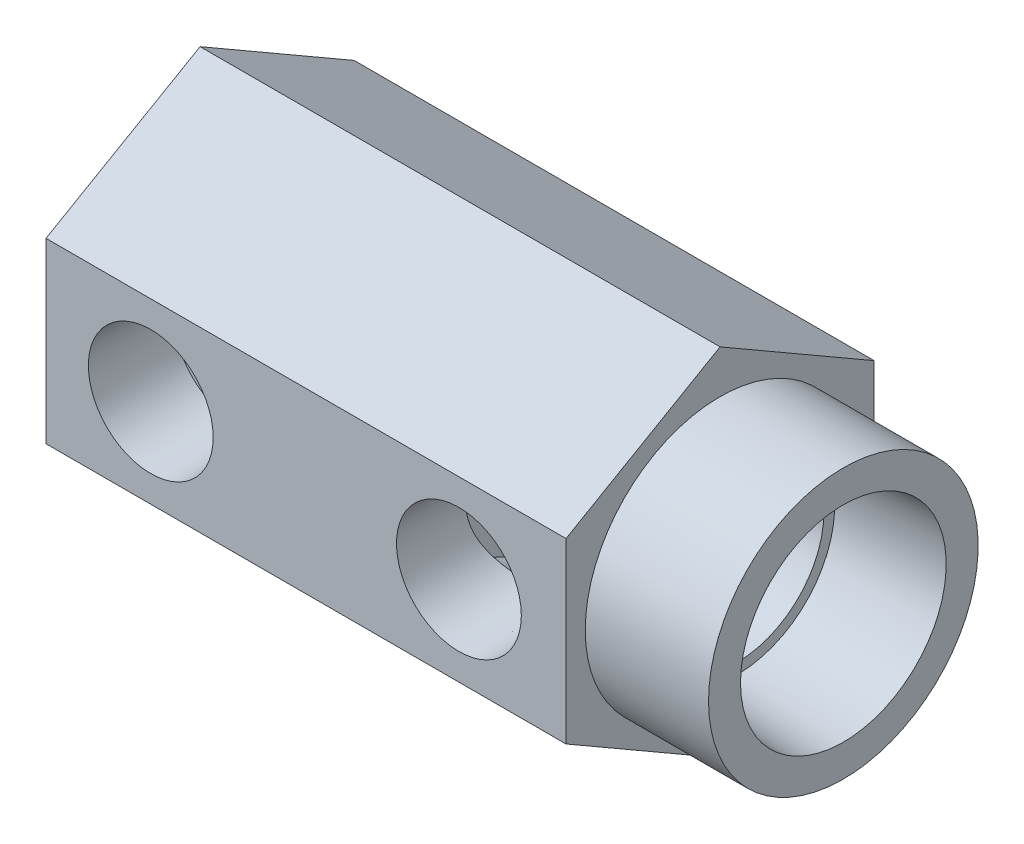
ISO-10303-21;
HEADER;
FILE_DESCRIPTION(('STEP AP214'),'2;1');
FILE_NAME('part.step','',(''),(''),'','','');
FILE_SCHEMA(('AUTOMOTIVE_DESIGN { 1 0 10303 214 1 1 1 1 }'));
ENDSEC;
DATA;
#1=APPLICATION_CONTEXT('core data for automotive mechanical design processes');
#2=APPLICATION_PROTOCOL_DEFINITION('international standard','automotive_design',2000,#1);
#3=PRODUCT_CONTEXT('',#1,'mechanical');
#4=PRODUCT('Part','Part','',(#3));
#5=PRODUCT_RELATED_PRODUCT_CATEGORY('part','',(#4));
#6=PRODUCT_DEFINITION_FORMATION('','',#4);
#7=PRODUCT_DEFINITION_CONTEXT('part definition',#1,'design');
#8=PRODUCT_DEFINITION('design','',#6,#7);
#9=PRODUCT_DEFINITION_SHAPE('','',#8);
#10=(LENGTH_UNIT() NAMED_UNIT(*) SI_UNIT(.MILLI.,.METRE.));
#11=(NAMED_UNIT(*) PLANE_ANGLE_UNIT() SI_UNIT($,.RADIAN.));
#12=(NAMED_UNIT(*) SI_UNIT($,.STERADIAN.) SOLID_ANGLE_UNIT());
#13=UNCERTAINTY_MEASURE_WITH_UNIT(LENGTH_MEASURE(1.E-05),#10,'distance_accuracy_value','');
#14=(GEOMETRIC_REPRESENTATION_CONTEXT(3) GLOBAL_UNCERTAINTY_ASSIGNED_CONTEXT((#13)) GLOBAL_UNIT_ASSIGNED_CONTEXT((#10,
#11,#12)) REPRESENTATION_CONTEXT('',''));
#15=CARTESIAN_POINT('',(0.,0.,0.));
#16=DIRECTION('',(0.,0.,1.));
#17=DIRECTION('',(1.,0.,0.));
#18=AXIS2_PLACEMENT_3D('',#15,#16,#17);
#19=CARTESIAN_POINT('',(42.8625,-7.33234841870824,-12.7));
#20=DIRECTION('',(0.,0.,1.));
#21=DIRECTION('',(1.,0.,0.));
#22=AXIS2_PLACEMENT_3D('',#19,#20,#21);
#23=PLANE('',#22);
#24=DIRECTION('',(0.,1.,0.));
#25=VECTOR('',#24,1.);
#26=CARTESIAN_POINT('',(0.,-7.33234841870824,-12.7));
#27=LINE('',#26,#25);
#28=CARTESIAN_POINT('',(0.,-7.33234841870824,-12.7));
#29=VERTEX_POINT('',#28);
#30=CARTESIAN_POINT('',(0.,7.33234841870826,-12.7));
#31=VERTEX_POINT('',#30);
#32=EDGE_CURVE('E121',#29,#31,#27,.T.);
#33=ORIENTED_EDGE('',*,*,#32,.T.);
#34=DIRECTION('',(-1.,0.,0.));
#35=VECTOR('',#34,1.);
#36=CARTESIAN_POINT('',(42.8625,7.33234841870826,-12.7));
#37=LINE('',#36,#35);
#38=CARTESIAN_POINT('',(42.8625,7.33234841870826,-12.7));
#39=VERTEX_POINT('',#38);
#40=EDGE_CURVE('E118',#39,#31,#37,.T.);
#41=ORIENTED_EDGE('',*,*,#40,.F.);
#42=DIRECTION('',(0.,1.,0.));
#43=VECTOR('',#42,1.);
#44=CARTESIAN_POINT('',(42.8625,-7.33234841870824,-12.7));
#45=LINE('',#44,#43);
#46=CARTESIAN_POINT('',(42.8625,-7.33234841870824,-12.7));
#47=VERTEX_POINT('',#46);
#48=EDGE_CURVE('E105',#47,#39,#45,.T.);
#49=ORIENTED_EDGE('',*,*,#48,.F.);
#50=DIRECTION('',(-1.,0.,0.));
#51=VECTOR('',#50,1.);
#52=CARTESIAN_POINT('',(42.8625,-7.33234841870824,-12.7));
#53=LINE('',#52,#51);
#54=EDGE_CURVE('E124',#47,#29,#53,.T.);
#55=ORIENTED_EDGE('',*,*,#54,.T.);
#56=EDGE_LOOP('',(#33,#41,#49,#55));
#57=FACE_BOUND('',#56,.T.);
#58=CARTESIAN_POINT('',(8.636,0.,-12.7));
#59=DIRECTION('',(0.,0.,-1.));
#60=DIRECTION('',(-1.,0.,0.));
#61=AXIS2_PLACEMENT_3D('',#58,#59,#60);
#62=CIRCLE('',#61,5.1435);
#63=CARTESIAN_POINT('',(3.4925,0.,-12.7));
#64=VERTEX_POINT('',#63);
#65=EDGE_CURVE('E198',#64,#64,#62,.T.);
#66=ORIENTED_EDGE('',*,*,#65,.F.);
#67=EDGE_LOOP('',(#66));
#68=FACE_BOUND('',#67,.T.);
#69=ADVANCED_FACE('F35',(#57,#68),#23,.F.);
#70=CARTESIAN_POINT('',(53.0225,0.,0.));
#71=DIRECTION('',(-1.,0.,0.));
#72=DIRECTION('',(0.,0.,1.));
#73=AXIS2_PLACEMENT_3D('',#70,#71,#72);
#74=PLANE('',#73);
#75=CARTESIAN_POINT('',(53.0225,0.,0.));
#76=DIRECTION('',(-1.,0.,0.));
#77=DIRECTION('',(0.,0.,1.));
#78=AXIS2_PLACEMENT_3D('',#75,#76,#77);
#79=CIRCLE('',#78,11.1125);
#80=CARTESIAN_POINT('',(53.0225,0.,11.1125));
#81=VERTEX_POINT('',#80);
#82=EDGE_CURVE('E137',#81,#81,#79,.T.);
#83=ORIENTED_EDGE('',*,*,#82,.F.);
#84=EDGE_LOOP('',(#83));
#85=FACE_BOUND('',#84,.T.);
#86=CARTESIAN_POINT('',(53.0225,0.,0.));
#87=DIRECTION('',(-1.,0.,0.));
#88=DIRECTION('',(0.,0.,1.));
#89=AXIS2_PLACEMENT_3D('',#86,#87,#88);
#90=CIRCLE('',#89,8.47725);
#91=CARTESIAN_POINT('',(53.0225,0.,8.47725));
#92=VERTEX_POINT('',#91);
#93=EDGE_CURVE('E272',#92,#92,#90,.T.);
#94=ORIENTED_EDGE('',*,*,#93,.T.);
#95=EDGE_LOOP('',(#94));
#96=FACE_BOUND('',#95,.T.);
#97=ADVANCED_FACE('F229',(#85,#96),#74,.F.);
#98=CARTESIAN_POINT('',(42.8625,7.33234841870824,12.7));
#99=DIRECTION('',(0.,0.,-1.));
#100=DIRECTION('',(0.,1.,0.));
#101=AXIS2_PLACEMENT_3D('',#98,#99,#100);
#102=PLANE('',#101);
#103=CARTESIAN_POINT('',(8.636,0.,12.7));
#104=DIRECTION('',(0.,0.,1.));
#105=DIRECTION('',(1.,0.,0.));
#106=AXIS2_PLACEMENT_3D('',#103,#104,#105);
#107=CIRCLE('',#106,5.1435);
#108=CARTESIAN_POINT('',(13.7795,0.,12.7));
#109=VERTEX_POINT('',#108);
#110=EDGE_CURVE('E291',#109,#109,#107,.T.);
#111=ORIENTED_EDGE('',*,*,#110,.F.);
#112=EDGE_LOOP('',(#111));
#113=FACE_BOUND('',#112,.T.);
#114=CARTESIAN_POINT('',(34.036,0.,12.7));
#115=DIRECTION('',(0.,0.,1.));
#116=DIRECTION('',(1.,0.,0.));
#117=AXIS2_PLACEMENT_3D('',#114,#115,#116);
#118=CIRCLE('',#117,5.1435);
#119=CARTESIAN_POINT('',(39.1795,0.,12.7));
#120=VERTEX_POINT('',#119);
#121=EDGE_CURVE('E282',#120,#120,#118,.T.);
#122=ORIENTED_EDGE('',*,*,#121,.F.);
#123=EDGE_LOOP('',(#122));
#124=FACE_BOUND('',#123,.T.);
#125=DIRECTION('',(0.,-1.,0.));
#126=VECTOR('',#125,1.);
#127=CARTESIAN_POINT('',(0.,7.33234841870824,12.7));
#128=LINE('',#127,#126);
#129=CARTESIAN_POINT('',(0.,7.33234841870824,12.7));
#130=VERTEX_POINT('',#129);
#131=CARTESIAN_POINT('',(0.,-7.33234841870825,12.7));
#132=VERTEX_POINT('',#131);
#133=EDGE_CURVE('E133',#130,#132,#128,.T.);
#134=ORIENTED_EDGE('',*,*,#133,.T.);
#135=DIRECTION('',(-1.,0.,0.));
#136=VECTOR('',#135,1.);
#137=CARTESIAN_POINT('',(42.8625,-7.33234841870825,12.7));
#138=LINE('',#137,#136);
#139=CARTESIAN_POINT('',(42.8625,-7.33234841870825,12.7));
#140=VERTEX_POINT('',#139);
#141=EDGE_CURVE('E152',#140,#132,#138,.T.);
#142=ORIENTED_EDGE('',*,*,#141,.F.);
#143=DIRECTION('',(0.,-1.,0.));
#144=VECTOR('',#143,1.);
#145=CARTESIAN_POINT('',(42.8625,7.33234841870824,12.7));
#146=LINE('',#145,#144);
#147=CARTESIAN_POINT('',(42.8625,7.33234841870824,12.7));
#148=VERTEX_POINT('',#147);
#149=EDGE_CURVE('E145',#148,#140,#146,.T.);
#150=ORIENTED_EDGE('',*,*,#149,.F.);
#151=DIRECTION('',(-1.,0.,0.));
#152=VECTOR('',#151,1.);
#153=CARTESIAN_POINT('',(42.8625,7.33234841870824,12.7));
#154=LINE('',#153,#152);
#155=EDGE_CURVE('E129',#148,#130,#154,.T.);
#156=ORIENTED_EDGE('',*,*,#155,.T.);
#157=EDGE_LOOP('',(#134,#142,#150,#156));
#158=FACE_BOUND('',#157,.T.);
#159=ADVANCED_FACE('F37',(#113,#124,#158),#102,.F.);
#160=CARTESIAN_POINT('',(42.8625,-7.33234841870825,12.7));
#161=DIRECTION('',(0.,0.866025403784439,-0.5));
#162=DIRECTION('',(0.,0.5,0.866025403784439));
#163=AXIS2_PLACEMENT_3D('',#160,#161,#162);
#164=PLANE('',#163);
#165=DIRECTION('',(0.,-0.5,-0.866025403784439));
#166=VECTOR('',#165,1.);
#167=CARTESIAN_POINT('',(0.,-7.33234841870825,12.7));
#168=LINE('',#167,#166);
#169=CARTESIAN_POINT('',(0.,-14.6646968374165,0.));
#170=VERTEX_POINT('',#169);
#171=EDGE_CURVE('E136',#132,#170,#168,.T.);
#172=ORIENTED_EDGE('',*,*,#171,.T.);
#173=DIRECTION('',(-1.,0.,0.));
#174=VECTOR('',#173,1.);
#175=CARTESIAN_POINT('',(42.8625,-14.6646968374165,0.));
#176=LINE('',#175,#174);
#177=CARTESIAN_POINT('',(42.8625,-14.6646968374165,0.));
#178=VERTEX_POINT('',#177);
#179=EDGE_CURVE('E149',#178,#170,#176,.T.);
#180=ORIENTED_EDGE('',*,*,#179,.F.);
#181=DIRECTION('',(0.,-0.5,-0.866025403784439));
#182=VECTOR('',#181,1.);
#183=CARTESIAN_POINT('',(42.8625,-7.33234841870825,12.7));
#184=LINE('',#183,#182);
#185=EDGE_CURVE('E96',#140,#178,#184,.T.);
#186=ORIENTED_EDGE('',*,*,#185,.F.);
#187=ORIENTED_EDGE('',*,*,#141,.T.);
#188=EDGE_LOOP('',(#172,#180,#186,#187));
#189=FACE_BOUND('',#188,.T.);
#190=ADVANCED_FACE('F241',(#189),#164,.F.);
#191=CARTESIAN_POINT('',(42.8625,-14.6646968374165,0.));
#192=DIRECTION('',(0.,0.866025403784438,0.500000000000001));
#193=DIRECTION('',(0.,-0.500000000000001,0.866025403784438));
#194=AXIS2_PLACEMENT_3D('',#191,#192,#193);
#195=PLANE('',#194);
#196=DIRECTION('',(0.,0.500000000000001,-0.866025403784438));
#197=VECTOR('',#196,1.);
#198=CARTESIAN_POINT('',(0.,-14.6646968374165,0.));
#199=LINE('',#198,#197);
#200=EDGE_CURVE('E139',#170,#29,#199,.T.);
#201=ORIENTED_EDGE('',*,*,#200,.T.);
#202=ORIENTED_EDGE('',*,*,#54,.F.);
#203=DIRECTION('',(0.,0.500000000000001,-0.866025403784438));
#204=VECTOR('',#203,1.);
#205=CARTESIAN_POINT('',(42.8625,-14.6646968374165,0.));
#206=LINE('',#205,#204);
#207=EDGE_CURVE('E112',#178,#47,#206,.T.);
#208=ORIENTED_EDGE('',*,*,#207,.F.);
#209=ORIENTED_EDGE('',*,*,#179,.T.);
#210=EDGE_LOOP('',(#201,#202,#208,#209));
#211=FACE_BOUND('',#210,.T.);
#212=ADVANCED_FACE('F239',(#211),#195,.F.);
#213=CARTESIAN_POINT('',(42.8625,7.33234841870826,-12.7));
#214=DIRECTION('',(0.,-0.866025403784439,0.5));
#215=DIRECTION('',(0.,-0.5,-0.866025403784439));
#216=AXIS2_PLACEMENT_3D('',#213,#214,#215);
#217=PLANE('',#216);
#218=DIRECTION('',(0.,0.5,0.866025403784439));
#219=VECTOR('',#218,1.);
#220=CARTESIAN_POINT('',(0.,7.33234841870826,-12.7));
#221=LINE('',#220,#219);
#222=CARTESIAN_POINT('',(0.,14.6646968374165,0.));
#223=VERTEX_POINT('',#222);
#224=EDGE_CURVE('E142',#31,#223,#221,.T.);
#225=ORIENTED_EDGE('',*,*,#224,.T.);
#226=DIRECTION('',(-1.,0.,0.));
#227=VECTOR('',#226,1.);
#228=CARTESIAN_POINT('',(42.8625,14.6646968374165,0.));
#229=LINE('',#228,#227);
#230=CARTESIAN_POINT('',(42.8625,14.6646968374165,0.));
#231=VERTEX_POINT('',#230);
#232=EDGE_CURVE('E125',#231,#223,#229,.T.);
#233=ORIENTED_EDGE('',*,*,#232,.F.);
#234=DIRECTION('',(0.,0.5,0.866025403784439));
#235=VECTOR('',#234,1.);
#236=CARTESIAN_POINT('',(42.8625,7.33234841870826,-12.7));
#237=LINE('',#236,#235);
#238=EDGE_CURVE('E109',#39,#231,#237,.T.);
#239=ORIENTED_EDGE('',*,*,#238,.F.);
#240=ORIENTED_EDGE('',*,*,#40,.T.);
#241=EDGE_LOOP('',(#225,#233,#239,#240));
#242=FACE_BOUND('',#241,.T.);
#243=ADVANCED_FACE('F127',(#242),#217,.F.);
#244=CARTESIAN_POINT('',(42.8625,14.6646968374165,0.));
#245=DIRECTION('',(0.,-0.866025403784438,-0.5));
#246=DIRECTION('',(0.,0.5,-0.866025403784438));
#247=AXIS2_PLACEMENT_3D('',#244,#245,#246);
#248=PLANE('',#247);
#249=DIRECTION('',(0.,-0.5,0.866025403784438));
#250=VECTOR('',#249,1.);
#251=CARTESIAN_POINT('',(0.,14.6646968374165,0.));
#252=LINE('',#251,#250);
#253=EDGE_CURVE('E87',#223,#130,#252,.T.);
#254=ORIENTED_EDGE('',*,*,#253,.T.);
#255=ORIENTED_EDGE('',*,*,#155,.F.);
#256=DIRECTION('',(0.,-0.5,0.866025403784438));
#257=VECTOR('',#256,1.);
#258=CARTESIAN_POINT('',(42.8625,14.6646968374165,0.));
#259=LINE('',#258,#257);
#260=EDGE_CURVE('E60',#231,#148,#259,.T.);
#261=ORIENTED_EDGE('',*,*,#260,.F.);
#262=ORIENTED_EDGE('',*,*,#232,.T.);
#263=EDGE_LOOP('',(#254,#255,#261,#262));
#264=FACE_BOUND('',#263,.T.);
#265=ADVANCED_FACE('F253',(#264),#248,.F.);
#266=CARTESIAN_POINT('',(42.8625,-7.33234841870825,12.7));
#267=DIRECTION('',(1.,0.,0.));
#268=DIRECTION('',(0.,0.,-1.));
#269=AXIS2_PLACEMENT_3D('',#266,#267,#268);
#270=PLANE('',#269);
#271=CARTESIAN_POINT('',(42.8625,0.,0.));
#272=DIRECTION('',(1.,0.,0.));
#273=DIRECTION('',(0.,0.,-1.));
#274=AXIS2_PLACEMENT_3D('',#271,#272,#273);
#275=CIRCLE('',#274,11.1125);
#276=CARTESIAN_POINT('',(42.8625,0.,11.1125));
#277=VERTEX_POINT('',#276);
#278=EDGE_CURVE('E154',#277,#277,#275,.T.);
#279=ORIENTED_EDGE('',*,*,#278,.F.);
#280=EDGE_LOOP('',(#279));
#281=FACE_BOUND('',#280,.T.);
#282=ORIENTED_EDGE('',*,*,#149,.T.);
#283=ORIENTED_EDGE('',*,*,#185,.T.);
#284=ORIENTED_EDGE('',*,*,#207,.T.);
#285=ORIENTED_EDGE('',*,*,#48,.T.);
#286=ORIENTED_EDGE('',*,*,#238,.T.);
#287=ORIENTED_EDGE('',*,*,#260,.T.);
#288=EDGE_LOOP('',(#282,#283,#284,#285,#286,#287));
#289=FACE_BOUND('',#288,.T.);
#290=ADVANCED_FACE('F107',(#281,#289),#270,.T.);
#291=CARTESIAN_POINT('',(0.,-7.33234841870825,12.7));
#292=DIRECTION('',(1.,0.,0.));
#293=DIRECTION('',(0.,0.,-1.));
#294=AXIS2_PLACEMENT_3D('',#291,#292,#293);
#295=PLANE('',#294);
#296=ORIENTED_EDGE('',*,*,#133,.F.);
#297=ORIENTED_EDGE('',*,*,#253,.F.);
#298=ORIENTED_EDGE('',*,*,#224,.F.);
#299=ORIENTED_EDGE('',*,*,#32,.F.);
#300=ORIENTED_EDGE('',*,*,#200,.F.);
#301=ORIENTED_EDGE('',*,*,#171,.F.);
#302=EDGE_LOOP('',(#296,#297,#298,#299,#300,#301));
#303=FACE_BOUND('',#302,.T.);
#304=ADVANCED_FACE('F252',(#303),#295,.F.);
#305=CARTESIAN_POINT('',(53.0225,0.,0.));
#306=DIRECTION('',(-1.,0.,0.));
#307=DIRECTION('',(0.,0.,1.));
#308=AXIS2_PLACEMENT_3D('',#305,#306,#307);
#309=CYLINDRICAL_SURFACE('',#308,11.1125);
#310=CARTESIAN_POINT('',(42.8625,0.,11.1125));
#311=CARTESIAN_POINT('',(42.9683333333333,0.,11.1125));
#312=CARTESIAN_POINT('',(43.0741666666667,0.,11.1125));
#313=CARTESIAN_POINT('',(43.2858333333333,0.,11.1125));
#314=CARTESIAN_POINT('',(43.3916666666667,0.,11.1125));
#315=CARTESIAN_POINT('',(43.6033333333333,0.,11.1125));
#316=CARTESIAN_POINT('',(43.7091666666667,0.,11.1125));
#317=CARTESIAN_POINT('',(43.9208333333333,0.,11.1125));
#318=CARTESIAN_POINT('',(44.0266666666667,0.,11.1125));
#319=CARTESIAN_POINT('',(44.2383333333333,0.,11.1125));
#320=CARTESIAN_POINT('',(44.3441666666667,0.,11.1125));
#321=CARTESIAN_POINT('',(44.5558333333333,0.,11.1125));
#322=CARTESIAN_POINT('',(44.6616666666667,0.,11.1125));
#323=CARTESIAN_POINT('',(44.8733333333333,0.,11.1125));
#324=CARTESIAN_POINT('',(44.9791666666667,0.,11.1125));
#325=CARTESIAN_POINT('',(45.1908333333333,0.,11.1125));
#326=CARTESIAN_POINT('',(45.2966666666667,0.,11.1125));
#327=CARTESIAN_POINT('',(45.5083333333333,0.,11.1125));
#328=CARTESIAN_POINT('',(45.6141666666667,0.,11.1125));
#329=CARTESIAN_POINT('',(45.8258333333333,0.,11.1125));
#330=CARTESIAN_POINT('',(45.9316666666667,0.,11.1125));
#331=CARTESIAN_POINT('',(46.1433333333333,0.,11.1125));
#332=CARTESIAN_POINT('',(46.2491666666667,0.,11.1125));
#333=CARTESIAN_POINT('',(46.4608333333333,0.,11.1125));
#334=CARTESIAN_POINT('',(46.5666666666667,0.,11.1125));
#335=CARTESIAN_POINT('',(46.7783333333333,0.,11.1125));
#336=CARTESIAN_POINT('',(46.8841666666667,0.,11.1125));
#337=CARTESIAN_POINT('',(47.0958333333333,0.,11.1125));
#338=CARTESIAN_POINT('',(47.2016666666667,0.,11.1125));
#339=CARTESIAN_POINT('',(47.4133333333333,0.,11.1125));
#340=CARTESIAN_POINT('',(47.5191666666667,0.,11.1125));
#341=CARTESIAN_POINT('',(47.7308333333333,0.,11.1125));
#342=CARTESIAN_POINT('',(47.8366666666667,0.,11.1125));
#343=CARTESIAN_POINT('',(48.0483333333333,0.,11.1125));
#344=CARTESIAN_POINT('',(48.1541666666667,0.,11.1125));
#345=CARTESIAN_POINT('',(48.3658333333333,0.,11.1125));
#346=CARTESIAN_POINT('',(48.4716666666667,0.,11.1125));
#347=CARTESIAN_POINT('',(48.6833333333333,0.,11.1125));
#348=CARTESIAN_POINT('',(48.7891666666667,0.,11.1125));
#349=CARTESIAN_POINT('',(49.0008333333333,0.,11.1125));
#350=CARTESIAN_POINT('',(49.1066666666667,0.,11.1125));
#351=CARTESIAN_POINT('',(49.3183333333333,0.,11.1125));
#352=CARTESIAN_POINT('',(49.4241666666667,0.,11.1125));
#353=CARTESIAN_POINT('',(49.6358333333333,0.,11.1125));
#354=CARTESIAN_POINT('',(49.7416666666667,0.,11.1125));
#355=CARTESIAN_POINT('',(49.9533333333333,0.,11.1125));
#356=CARTESIAN_POINT('',(50.0591666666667,0.,11.1125));
#357=CARTESIAN_POINT('',(50.2708333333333,0.,11.1125));
#358=CARTESIAN_POINT('',(50.3766666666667,0.,11.1125));
#359=CARTESIAN_POINT('',(50.5883333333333,0.,11.1125));
#360=CARTESIAN_POINT('',(50.6941666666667,0.,11.1125));
#361=CARTESIAN_POINT('',(50.9058333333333,0.,11.1125));
#362=CARTESIAN_POINT('',(51.0116666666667,0.,11.1125));
#363=CARTESIAN_POINT('',(51.2233333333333,0.,11.1125));
#364=CARTESIAN_POINT('',(51.3291666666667,0.,11.1125));
#365=CARTESIAN_POINT('',(51.5408333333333,0.,11.1125));
#366=CARTESIAN_POINT('',(51.6466666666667,0.,11.1125));
#367=CARTESIAN_POINT('',(51.8583333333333,0.,11.1125));
#368=CARTESIAN_POINT('',(51.9641666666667,0.,11.1125));
#369=CARTESIAN_POINT('',(52.1758333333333,0.,11.1125));
#370=CARTESIAN_POINT('',(52.2816666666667,0.,11.1125));
#371=CARTESIAN_POINT('',(52.4933333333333,0.,11.1125));
#372=CARTESIAN_POINT('',(52.5991666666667,0.,11.1125));
#373=CARTESIAN_POINT('',(52.8108333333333,0.,11.1125));
#374=CARTESIAN_POINT('',(52.9166666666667,0.,11.1125));
#375=CARTESIAN_POINT('',(53.0225,0.,11.1125));
#376=B_SPLINE_CURVE_WITH_KNOTS('',3,(#310,#311,#312,#313,#314,#315,#316,#317,#318,#319,#320,
#321,#322,#323,#324,#325,#326,#327,#328,#329,#330,#331,#332,#333,#334,#335,#336,#337,#338,#339,
#340,#341,#342,#343,#344,#345,#346,#347,#348,#349,#350,#351,#352,#353,#354,#355,#356,#357,#358,
#359,#360,#361,#362,#363,#364,#365,#366,#367,#368,#369,#370,#371,#372,#373,#374,#375),
.UNSPECIFIED.,.F.,.F.,(4,2,2,2,2,2,2,2,2,2,2,2,2,2,2,2,2,2,2,2,2,2,2,2,2,2,2,2,2,2,2,2,4),(0.,
0.317500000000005,0.635000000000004,0.952500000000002,1.27,1.5875,1.905,2.2225,2.54,
2.85750000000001,3.175,3.4925,3.81,4.12750000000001,4.445,4.7625,5.08,5.39750000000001,
5.71500000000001,6.0325,6.35,6.66750000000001,6.985,7.3025,7.62,7.93750000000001,
8.25500000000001,8.5725,8.89000000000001,9.20750000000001,9.52500000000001,9.8425,10.16),.UNSPECIFIED.);
#377=EDGE_CURVE('BSEAM342',#277,#81,#376,.T.);
#378=ORIENTED_EDGE('',*,*,#278,.T.);
#379=ORIENTED_EDGE('',*,*,#82,.T.);
#380=ORIENTED_EDGE('',*,*,#377,.T.);
#381=ORIENTED_EDGE('',*,*,#377,.F.);
#382=EDGE_LOOP('',(#378,#380,#379,#381));
#383=FACE_BOUND('',#382,.T.);
#384=ADVANCED_FACE('F342',(#383),#309,.T.);
#385=CARTESIAN_POINT('',(27.6225,0.,0.));
#386=DIRECTION('',(1.,0.,0.));
#387=DIRECTION('',(0.,0.,-1.));
#388=AXIS2_PLACEMENT_3D('',#385,#386,#387);
#389=PLANE('',#388);
#390=CARTESIAN_POINT('',(27.6225,0.,0.));
#391=DIRECTION('',(1.,0.,0.));
#392=DIRECTION('',(0.,0.,-1.));
#393=AXIS2_PLACEMENT_3D('',#390,#391,#392);
#394=CIRCLE('',#393,3.96874999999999);
#395=CARTESIAN_POINT('',(27.6225,0.,-3.96874999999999));
#396=VERTEX_POINT('',#395);
#397=EDGE_CURVE('E199',#396,#396,#394,.T.);
#398=ORIENTED_EDGE('',*,*,#397,.F.);
#399=EDGE_LOOP('',(#398));
#400=FACE_BOUND('',#399,.T.);
#401=CARTESIAN_POINT('',(27.6225,0.,0.));
#402=DIRECTION('',(-1.,0.,0.));
#403=DIRECTION('',(0.,0.,1.));
#404=AXIS2_PLACEMENT_3D('',#401,#402,#403);
#405=CIRCLE('',#404,7.13739999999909);
#406=CARTESIAN_POINT('',(27.6225,0.,7.13739999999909));
#407=VERTEX_POINT('',#406);
#408=EDGE_CURVE('E263',#407,#407,#405,.T.);
#409=ORIENTED_EDGE('',*,*,#408,.F.);
#410=EDGE_LOOP('',(#409));
#411=FACE_BOUND('',#410,.T.);
#412=ADVANCED_FACE('F337',(#400,#411),#389,.T.);
#413=CARTESIAN_POINT('',(0.,0.,0.));
#414=DIRECTION('',(-1.,0.,0.));
#415=DIRECTION('',(0.,0.,1.));
#416=AXIS2_PLACEMENT_3D('',#413,#414,#415);
#417=CYLINDRICAL_SURFACE('',#416,7.13739999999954);
#418=CARTESIAN_POINT('',(36.6403785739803,4.19321775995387,5.77576000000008));
#419=CARTESIAN_POINT('',(36.7650119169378,4.11771508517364,5.83059156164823));
#420=CARTESIAN_POINT('',(36.8858659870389,4.03706746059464,5.88686598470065));
#421=CARTESIAN_POINT('',(37.1196818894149,3.86579522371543,6.00071898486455));
#422=CARTESIAN_POINT('',(37.2326419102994,3.77516833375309,6.05829785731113));
#423=CARTESIAN_POINT('',(37.4512713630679,3.58341466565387,6.17367551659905));
#424=CARTESIAN_POINT('',(37.5568648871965,3.48219964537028,6.23147151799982));
#425=CARTESIAN_POINT('',(37.7590912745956,3.27025062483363,6.34526615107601));
#426=CARTESIAN_POINT('',(37.8557246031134,3.15951711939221,6.40126487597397));
#427=CARTESIAN_POINT('',(38.0396648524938,2.92847691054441,6.51021233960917));
#428=CARTESIAN_POINT('',(38.126940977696,2.80814074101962,6.56315075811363));
#429=CARTESIAN_POINT('',(38.2909670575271,2.55866580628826,6.66436989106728));
#430=CARTESIAN_POINT('',(38.3677188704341,2.42952860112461,6.7126514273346));
#431=CARTESIAN_POINT('',(38.5094697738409,2.16358939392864,6.8030129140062));
#432=CARTESIAN_POINT('',(38.5745149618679,2.02682036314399,6.84511706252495));
#433=CARTESIAN_POINT('',(38.6921777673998,1.74615263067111,6.92203913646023));
#434=CARTESIAN_POINT('',(38.7448002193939,1.6022567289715,6.95685989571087));
#435=CARTESIAN_POINT('',(38.8586305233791,1.23803887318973,7.03269631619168));
#436=CARTESIAN_POINT('',(38.9119045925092,1.01408401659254,7.06870792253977));
#437=CARTESIAN_POINT('',(38.9863415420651,0.558543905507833,7.11920088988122));
#438=CARTESIAN_POINT('',(39.0075095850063,0.326959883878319,7.13368571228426));
#439=CARTESIAN_POINT('',(39.0165450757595,-0.13744487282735,7.13985621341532));
#440=CARTESIAN_POINT('',(39.0043757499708,-0.370266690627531,7.13151671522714));
#441=CARTESIAN_POINT('',(38.9473718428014,-0.829949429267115,7.09273709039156));
#442=CARTESIAN_POINT('',(38.9025322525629,-1.05680943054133,7.06229357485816));
#443=CARTESIAN_POINT('',(38.7832016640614,-1.49642728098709,6.98231041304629));
#444=CARTESIAN_POINT('',(38.7090102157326,-1.7093030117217,6.93296383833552));
#445=CARTESIAN_POINT('',(38.5341197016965,-2.1193932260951,6.81879969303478));
#446=CARTESIAN_POINT('',(38.4334082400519,-2.31660032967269,6.7539748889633));
#447=CARTESIAN_POINT('',(38.1948608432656,-2.71584695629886,6.60435580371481));
#448=CARTESIAN_POINT('',(38.0539846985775,-2.91550591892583,6.51808680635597));
#449=CARTESIAN_POINT('',(37.7465603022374,-3.28977186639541,6.33743506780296));
#450=CARTESIAN_POINT('',(37.5800058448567,-3.46437277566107,6.243050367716));
#451=CARTESIAN_POINT('',(37.2845898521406,-3.73218393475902,6.0851100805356));
#452=CARTESIAN_POINT('',(37.1621806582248,-3.83287610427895,6.02198975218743));
#453=CARTESIAN_POINT('',(36.9081372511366,-4.02213233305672,5.89727017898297));
#454=CARTESIAN_POINT('',(36.7765260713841,-4.11072514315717,5.8356676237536));
#455=CARTESIAN_POINT('',(36.6403785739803,-4.19321775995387,5.77576000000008));
#456=B_SPLINE_CURVE_WITH_KNOTS('',3,(#418,#419,#420,#421,#422,#423,#424,#425,#426,#427,#428,
#429,#430,#431,#432,#433,#434,#435,#436,#437,#438,#439,#440,#441,#442,#443,#444,#445,#446,#447,
#448,#449,#450,#451,#452,#453,#454,#455),.UNSPECIFIED.,.F.,.F.,(4,2,2,2,2,2,2,2,2,2,2,2,2,2,2,2,
2,2,4),(0.,0.466914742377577,0.933936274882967,1.40521815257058,1.8764755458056,2.3492391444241,
2.82191915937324,3.29269509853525,3.76328752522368,4.45898340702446,5.15456741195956,
5.85091900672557,6.54737738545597,7.23690419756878,7.92675388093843,8.70131916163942,
9.47607192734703,9.98726281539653,10.4972170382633),.UNSPECIFIED.);
#457=CARTESIAN_POINT('',(36.6408334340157,4.19294226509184,5.77596));
#458=VERTEX_POINT('',#457);
#459=CARTESIAN_POINT('',(36.6408334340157,-4.19294226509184,5.77596));
#460=VERTEX_POINT('',#459);
#461=EDGE_CURVE('E11',#458,#460,#456,.T.);
#462=ORIENTED_EDGE('',*,*,#461,.F.);
#463=DIRECTION('',(-1.,0.,0.));
#464=VECTOR('',#463,1.);
#465=CARTESIAN_POINT('',(0.,4.19294226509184,5.77596));
#466=LINE('',#465,#464);
#467=CARTESIAN_POINT('',(34.4801442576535,4.19294226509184,5.77596));
#468=VERTEX_POINT('',#467);
#469=EDGE_CURVE('E528',#468,#458,#466,.F.);
#470=ORIENTED_EDGE('',*,*,#469,.F.);
#471=CARTESIAN_POINT('',(33.5918557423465,4.19294226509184,5.77596));
#472=CARTESIAN_POINT('',(33.739903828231,4.20858075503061,5.76455891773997));
#473=CARTESIAN_POINT('',(33.8879519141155,4.2164,5.75885837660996));
#474=CARTESIAN_POINT('',(34.1840480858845,4.2164,5.75885837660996));
#475=CARTESIAN_POINT('',(34.332096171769,4.20858075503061,5.76455891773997));
#476=CARTESIAN_POINT('',(34.4801442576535,4.19294226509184,5.77596));
#477=B_SPLINE_CURVE_WITH_KNOTS('',3,(#471,#472,#473,#474,#475,#476),.UNSPECIFIED.,.F.,.F.,(4,2,
4),(0.,0.445091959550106,0.890183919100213),.UNSPECIFIED.);
#478=CARTESIAN_POINT('',(33.5918557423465,4.19294226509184,5.77596));
#479=VERTEX_POINT('',#478);
#480=EDGE_CURVE('E186',#479,#468,#477,.T.);
#481=ORIENTED_EDGE('',*,*,#480,.F.);
#482=CARTESIAN_POINT('',(31.4311665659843,4.19294226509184,5.77596));
#483=VERTEX_POINT('',#482);
#484=EDGE_CURVE('E163',#483,#479,#466,.F.);
#485=ORIENTED_EDGE('',*,*,#484,.F.);
#486=CARTESIAN_POINT('',(31.4316214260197,-4.19321775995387,5.77576000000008));
#487=CARTESIAN_POINT('',(31.3069880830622,-4.11771508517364,5.83059156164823));
#488=CARTESIAN_POINT('',(31.1861340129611,-4.03706746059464,5.88686598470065));
#489=CARTESIAN_POINT('',(30.9523181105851,-3.86579522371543,6.00071898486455));
#490=CARTESIAN_POINT('',(30.8393580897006,-3.7751683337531,6.05829785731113));
#491=CARTESIAN_POINT('',(30.6207286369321,-3.58341466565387,6.17367551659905));
#492=CARTESIAN_POINT('',(30.5151351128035,-3.48219964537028,6.23147151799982));
#493=CARTESIAN_POINT('',(30.3129087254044,-3.27025062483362,6.34526615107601));
#494=CARTESIAN_POINT('',(30.2162753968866,-3.15951711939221,6.40126487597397));
#495=CARTESIAN_POINT('',(30.0323351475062,-2.92847691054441,6.51021233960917));
#496=CARTESIAN_POINT('',(29.945059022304,-2.80814074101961,6.56315075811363));
#497=CARTESIAN_POINT('',(29.7810329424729,-2.55866580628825,6.66436989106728));
#498=CARTESIAN_POINT('',(29.7042811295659,-2.42952860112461,6.7126514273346));
#499=CARTESIAN_POINT('',(29.562530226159,-2.16358939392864,6.8030129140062));
#500=CARTESIAN_POINT('',(29.497485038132,-2.02682036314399,6.84511706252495));
#501=CARTESIAN_POINT('',(29.3798222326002,-1.74615263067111,6.92203913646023));
#502=CARTESIAN_POINT('',(29.3271997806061,-1.6022567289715,6.95685989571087));
#503=CARTESIAN_POINT('',(29.2133694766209,-1.23803887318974,7.03269631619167));
#504=CARTESIAN_POINT('',(29.1600954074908,-1.01408401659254,7.06870792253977));
#505=CARTESIAN_POINT('',(29.0856584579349,-0.558543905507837,7.11920088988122));
#506=CARTESIAN_POINT('',(29.0644904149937,-0.326959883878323,7.13368571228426));
#507=CARTESIAN_POINT('',(29.0554549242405,0.137444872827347,7.13985621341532));
#508=CARTESIAN_POINT('',(29.0676242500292,0.370266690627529,7.13151671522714));
#509=CARTESIAN_POINT('',(29.1246281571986,0.829949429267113,7.09273709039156));
#510=CARTESIAN_POINT('',(29.1694677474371,1.05680943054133,7.06229357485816));
#511=CARTESIAN_POINT('',(29.2887983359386,1.49642728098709,6.98231041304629));
#512=CARTESIAN_POINT('',(29.3629897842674,1.7093030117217,6.93296383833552));
#513=CARTESIAN_POINT('',(29.5378802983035,2.1193932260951,6.81879969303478));
#514=CARTESIAN_POINT('',(29.6385917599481,2.31660032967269,6.7539748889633));
#515=CARTESIAN_POINT('',(29.8771391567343,2.71584695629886,6.60435580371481));
#516=CARTESIAN_POINT('',(30.0180153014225,2.91550591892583,6.51808680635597));
#517=CARTESIAN_POINT('',(30.3254396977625,3.28977186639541,6.33743506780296));
#518=CARTESIAN_POINT('',(30.4919941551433,3.46437277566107,6.243050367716));
#519=CARTESIAN_POINT('',(30.7874101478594,3.73218393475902,6.0851100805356));
#520=CARTESIAN_POINT('',(30.9098193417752,3.83287610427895,6.02198975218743));
#521=CARTESIAN_POINT('',(31.1638627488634,4.02213233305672,5.89727017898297));
#522=CARTESIAN_POINT('',(31.2954739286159,4.11072514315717,5.8356676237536));
#523=CARTESIAN_POINT('',(31.4316214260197,4.19321775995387,5.77576000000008));
#524=B_SPLINE_CURVE_WITH_KNOTS('',3,(#486,#487,#488,#489,#490,#491,#492,#493,#494,#495,#496,
#497,#498,#499,#500,#501,#502,#503,#504,#505,#506,#507,#508,#509,#510,#511,#512,#513,#514,#515,
#516,#517,#518,#519,#520,#521,#522,#523),.UNSPECIFIED.,.F.,.F.,(4,2,2,2,2,2,2,2,2,2,2,2,2,2,2,2,
2,2,4),(0.,0.466914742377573,0.933936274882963,1.40521815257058,1.8764755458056,2.3492391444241,
2.82191915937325,3.29269509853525,3.76328752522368,4.45898340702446,5.15456741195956,
5.85091900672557,6.54737738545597,7.23690419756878,7.92675388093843,8.70131916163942,
9.47607192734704,9.98726281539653,10.4972170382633),.UNSPECIFIED.);
#525=CARTESIAN_POINT('',(31.4311665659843,-4.19294226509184,5.77596));
#526=VERTEX_POINT('',#525);
#527=EDGE_CURVE('E155',#526,#483,#524,.T.);
#528=ORIENTED_EDGE('',*,*,#527,.F.);
#529=DIRECTION('',(-1.,0.,0.));
#530=VECTOR('',#529,1.);
#531=CARTESIAN_POINT('',(0.,-4.19294226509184,5.77596));
#532=LINE('',#531,#530);
#533=CARTESIAN_POINT('',(33.5918557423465,-4.19294226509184,5.77596));
#534=VERTEX_POINT('',#533);
#535=EDGE_CURVE('E523',#534,#526,#532,.T.);
#536=ORIENTED_EDGE('',*,*,#535,.F.);
#537=CARTESIAN_POINT('',(34.4801442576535,-4.19294226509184,5.77596));
#538=CARTESIAN_POINT('',(34.332096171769,-4.20858075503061,5.76455891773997));
#539=CARTESIAN_POINT('',(34.1840480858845,-4.2164,5.75885837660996));
#540=CARTESIAN_POINT('',(33.8879519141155,-4.2164,5.75885837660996));
#541=CARTESIAN_POINT('',(33.739903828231,-4.20858075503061,5.76455891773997));
#542=CARTESIAN_POINT('',(33.5918557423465,-4.19294226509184,5.77596));
#543=B_SPLINE_CURVE_WITH_KNOTS('',3,(#537,#538,#539,#540,#541,#542),.UNSPECIFIED.,.F.,.F.,(4,2,
4),(0.,0.445091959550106,0.890183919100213),.UNSPECIFIED.);
#544=CARTESIAN_POINT('',(34.4801442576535,-4.19294226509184,5.77596));
#545=VERTEX_POINT('',#544);
#546=EDGE_CURVE('E517',#545,#534,#543,.T.);
#547=ORIENTED_EDGE('',*,*,#546,.F.);
#548=EDGE_CURVE('E44',#460,#545,#532,.T.);
#549=ORIENTED_EDGE('',*,*,#548,.F.);
#550=EDGE_LOOP('',(#462,#470,#481,#485,#528,#536,#547,#549));
#551=FACE_BOUND('',#550,.T.);
#552=ORIENTED_EDGE('',*,*,#408,.T.);
#553=EDGE_LOOP('',(#552));
#554=FACE_BOUND('',#553,.T.);
#555=CARTESIAN_POINT('',(44.2849,0.,0.));
#556=DIRECTION('',(-1.,0.,0.));
#557=DIRECTION('',(0.,0.,1.));
#558=AXIS2_PLACEMENT_3D('',#555,#556,#557);
#559=CIRCLE('',#558,7.1374);
#560=CARTESIAN_POINT('',(44.2849,0.,7.1374));
#561=VERTEX_POINT('',#560);
#562=EDGE_CURVE('E266',#561,#561,#559,.T.);
#563=ORIENTED_EDGE('',*,*,#562,.F.);
#564=EDGE_LOOP('',(#563));
#565=FACE_BOUND('',#564,.T.);
#566=ADVANCED_FACE('F165',(#551,#554,#565),#417,.F.);
#567=CARTESIAN_POINT('',(44.2849,7.1374,0.));
#568=DIRECTION('',(1.,0.,0.));
#569=DIRECTION('',(0.,0.,-1.));
#570=AXIS2_PLACEMENT_3D('',#567,#568,#569);
#571=PLANE('',#570);
#572=ORIENTED_EDGE('',*,*,#562,.T.);
#573=EDGE_LOOP('',(#572));
#574=FACE_BOUND('',#573,.T.);
#575=CARTESIAN_POINT('',(44.2849,0.,0.));
#576=DIRECTION('',(-1.,0.,0.));
#577=DIRECTION('',(0.,0.,1.));
#578=AXIS2_PLACEMENT_3D('',#575,#576,#577);
#579=CIRCLE('',#578,8.0193317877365);
#580=CARTESIAN_POINT('',(44.2849,0.,8.0193317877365));
#581=VERTEX_POINT('',#580);
#582=EDGE_CURVE('E269',#581,#581,#579,.T.);
#583=ORIENTED_EDGE('',*,*,#582,.F.);
#584=EDGE_LOOP('',(#583));
#585=FACE_BOUND('',#584,.T.);
#586=ADVANCED_FACE('F429',(#574,#585),#571,.T.);
#587=CARTESIAN_POINT('',(53.0225,0.,0.));
#588=DIRECTION('',(1.,0.,0.));
#589=DIRECTION('',(0.,0.,-1.));
#590=AXIS2_PLACEMENT_3D('',#587,#588,#589);
#591=CONICAL_SURFACE('',#590,8.47725,0.0523598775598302);
#592=ORIENTED_EDGE('',*,*,#582,.T.);
#593=EDGE_LOOP('',(#592));
#594=FACE_BOUND('',#593,.T.);
#595=ORIENTED_EDGE('',*,*,#93,.F.);
#596=EDGE_LOOP('',(#595));
#597=FACE_BOUND('',#596,.T.);
#598=ADVANCED_FACE('F420',(#594,#597),#591,.F.);
#599=CARTESIAN_POINT('',(38.2524,0.,5.77596));
#600=DIRECTION('',(0.,0.,-1.));
#601=DIRECTION('',(-1.,0.,0.));
#602=AXIS2_PLACEMENT_3D('',#599,#600,#601);
#603=PLANE('',#602);
#604=ORIENTED_EDGE('',*,*,#548,.T.);
#605=CARTESIAN_POINT('',(34.036,0.,5.77596));
#606=DIRECTION('',(0.,0.,1.));
#607=DIRECTION('',(1.,0.,0.));
#608=AXIS2_PLACEMENT_3D('',#605,#606,#607);
#609=CIRCLE('',#608,4.2164);
#610=EDGE_CURVE('E278',#534,#545,#609,.T.);
#611=ORIENTED_EDGE('',*,*,#610,.F.);
#612=ORIENTED_EDGE('',*,*,#535,.T.);
#613=CARTESIAN_POINT('',(34.036,0.,5.77596));
#614=DIRECTION('',(0.,0.,1.));
#615=DIRECTION('',(1.,0.,0.));
#616=AXIS2_PLACEMENT_3D('',#613,#614,#615);
#617=CIRCLE('',#616,4.93618496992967);
#618=EDGE_CURVE('E51',#526,#460,#617,.T.);
#619=ORIENTED_EDGE('',*,*,#618,.T.);
#620=EDGE_LOOP('',(#604,#611,#612,#619));
#621=FACE_BOUND('',#620,.T.);
#622=ADVANCED_FACE('F395',(#621),#603,.F.);
#623=CARTESIAN_POINT('',(34.036,0.,12.7));
#624=DIRECTION('',(0.,0.,1.));
#625=DIRECTION('',(1.,0.,0.));
#626=AXIS2_PLACEMENT_3D('',#623,#624,#625);
#627=CYLINDRICAL_SURFACE('',#626,4.2164);
#628=ORIENTED_EDGE('',*,*,#480,.T.);
#629=EDGE_CURVE('E275',#468,#479,#609,.T.);
#630=ORIENTED_EDGE('',*,*,#629,.T.);
#631=EDGE_LOOP('',(#628,#630));
#632=FACE_BOUND('',#631,.T.);
#633=ADVANCED_FACE('F403',(#632),#627,.F.);
#634=ORIENTED_EDGE('',*,*,#546,.T.);
#635=ORIENTED_EDGE('',*,*,#610,.T.);
#636=EDGE_LOOP('',(#634,#635));
#637=FACE_BOUND('',#636,.T.);
#638=ADVANCED_FACE('F393',(#637),#627,.F.);
#639=ORIENTED_EDGE('',*,*,#484,.T.);
#640=ORIENTED_EDGE('',*,*,#629,.F.);
#641=ORIENTED_EDGE('',*,*,#469,.T.);
#642=EDGE_CURVE('E279',#458,#483,#617,.T.);
#643=ORIENTED_EDGE('',*,*,#642,.T.);
#644=EDGE_LOOP('',(#639,#640,#641,#643));
#645=FACE_BOUND('',#644,.T.);
#646=ADVANCED_FACE('F175',(#645),#603,.F.);
#647=CARTESIAN_POINT('',(34.036,0.,12.7));
#648=DIRECTION('',(0.,0.,1.));
#649=DIRECTION('',(1.,0.,0.));
#650=AXIS2_PLACEMENT_3D('',#647,#648,#649);
#651=CONICAL_SURFACE('',#650,5.1435,0.0299323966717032);
#652=ORIENTED_EDGE('',*,*,#461,.T.);
#653=ORIENTED_EDGE('',*,*,#618,.F.);
#654=ORIENTED_EDGE('',*,*,#527,.T.);
#655=ORIENTED_EDGE('',*,*,#642,.F.);
#656=EDGE_LOOP('',(#652,#653,#654,#655));
#657=FACE_BOUND('',#656,.T.);
#658=ORIENTED_EDGE('',*,*,#121,.T.);
#659=EDGE_LOOP('',(#658));
#660=FACE_BOUND('',#659,.T.);
#661=ADVANCED_FACE('F169',(#657,#660),#651,.F.);
#662=CARTESIAN_POINT('',(8.636,0.,12.7));
#663=DIRECTION('',(0.,0.,1.));
#664=DIRECTION('',(1.,0.,0.));
#665=AXIS2_PLACEMENT_3D('',#662,#663,#664);
#666=CYLINDRICAL_SURFACE('',#665,4.2164);
#667=CARTESIAN_POINT('',(12.8524,0.,-3.45439999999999));
#668=CARTESIAN_POINT('',(12.852399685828,0.0824040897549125,-3.45439967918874));
#669=CARTESIAN_POINT('',(12.8499790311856,0.164813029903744,-3.4514462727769));
#670=CARTESIAN_POINT('',(12.8403522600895,0.328962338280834,-3.43968595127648));
#671=CARTESIAN_POINT('',(12.8331439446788,0.410702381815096,-3.43087634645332));
#672=CARTESIAN_POINT('',(12.814091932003,0.572933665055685,-3.40754288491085));
#673=CARTESIAN_POINT('',(12.8022417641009,0.653422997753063,-3.39301105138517));
#674=CARTESIAN_POINT('',(12.774173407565,0.812457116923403,-3.35848603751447));
#675=CARTESIAN_POINT('',(12.7579532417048,0.89100100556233,-3.33849038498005));
#676=CARTESIAN_POINT('',(12.7034644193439,1.12185925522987,-3.2710595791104));
#677=CARTESIAN_POINT('',(12.6592152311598,1.27063211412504,-3.21599682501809));
#678=CARTESIAN_POINT('',(12.5579265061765,1.55546743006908,-3.0883412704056));
#679=CARTESIAN_POINT('',(12.5008859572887,1.69152888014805,-3.015747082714));
#680=CARTESIAN_POINT('',(12.3549555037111,1.99629717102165,-2.82672059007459));
#681=CARTESIAN_POINT('',(12.2619889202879,2.15914666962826,-2.70391169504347));
#682=CARTESIAN_POINT('',(12.1154126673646,2.38322789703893,-2.50265002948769));
#683=CARTESIAN_POINT('',(12.0652631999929,2.45467355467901,-2.4325706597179));
#684=CARTESIAN_POINT('',(11.9636075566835,2.59080099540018,-2.28703780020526));
#685=CARTESIAN_POINT('',(11.9121018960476,2.65548530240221,-2.21158633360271));
#686=CARTESIAN_POINT('',(11.8079415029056,2.77911259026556,-2.05416874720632));
#687=CARTESIAN_POINT('',(11.7552823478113,2.83793636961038,-1.97211225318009));
#688=CARTESIAN_POINT('',(11.6510064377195,2.94848021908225,-1.80265932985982));
#689=CARTESIAN_POINT('',(11.5993900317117,3.00019794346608,-1.71526115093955));
#690=CARTESIAN_POINT('',(11.4989676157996,3.09616756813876,-1.53525343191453));
#691=CARTESIAN_POINT('',(11.4501547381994,3.1404382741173,-1.44265783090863));
#692=CARTESIAN_POINT('',(11.3573105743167,3.22122342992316,-1.25192521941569));
#693=CARTESIAN_POINT('',(11.3132751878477,3.25774455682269,-1.15379307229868));
#694=CARTESIAN_POINT('',(11.2279001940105,3.32617089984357,-0.939941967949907));
#695=CARTESIAN_POINT('',(11.1874767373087,3.35703819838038,-0.823507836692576));
#696=CARTESIAN_POINT('',(11.1206591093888,3.40679587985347,-0.584350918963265));
#697=CARTESIAN_POINT('',(11.0942299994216,3.42571611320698,-0.461644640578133));
#698=CARTESIAN_POINT('',(11.0596601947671,3.45027581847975,-0.210852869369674));
#699=CARTESIAN_POINT('',(11.0517166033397,3.45577218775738,-0.0827241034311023));
#700=CARTESIAN_POINT('',(11.0564745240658,3.45243823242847,0.17298067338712));
#701=CARTESIAN_POINT('',(11.0691853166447,3.44360146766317,0.300556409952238));
#702=CARTESIAN_POINT('',(11.1150884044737,3.4107170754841,0.565507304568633));
#703=CARTESIAN_POINT('',(11.1505193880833,3.38499846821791,0.702263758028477));
#704=CARTESIAN_POINT('',(11.2369321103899,3.31905042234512,0.967241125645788));
#705=CARTESIAN_POINT('',(11.2879628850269,3.27877515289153,1.09543354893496));
#706=CARTESIAN_POINT('',(11.3867578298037,3.19602055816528,1.31484141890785));
#707=CARTESIAN_POINT('',(11.4326771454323,3.15607237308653,1.40789071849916));
#708=CARTESIAN_POINT('',(11.5279617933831,3.06899813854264,1.58877652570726));
#709=CARTESIAN_POINT('',(11.5773289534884,3.0218682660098,1.676610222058));
#710=CARTESIAN_POINT('',(11.6778451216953,2.92066855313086,1.84727592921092));
#711=CARTESIAN_POINT('',(11.7289963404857,2.86658986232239,1.93010135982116));
#712=CARTESIAN_POINT('',(11.8316549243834,2.75168221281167,2.09066179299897));
#713=CARTESIAN_POINT('',(11.8831622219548,2.69085450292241,2.16839773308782));
#714=CARTESIAN_POINT('',(11.9874322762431,2.55992422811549,2.32168641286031));
#715=CARTESIAN_POINT('',(12.040163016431,2.48954826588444,2.39702796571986));
#716=CARTESIAN_POINT('',(12.1436069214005,2.34155431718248,2.54179428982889));
#717=CARTESIAN_POINT('',(12.194319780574,2.26393523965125,2.61121816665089));
#718=CARTESIAN_POINT('',(12.292483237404,2.10169567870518,2.74347922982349));
#719=CARTESIAN_POINT('',(12.3399410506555,2.01709166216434,2.80633115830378));
#720=CARTESIAN_POINT('',(12.4305908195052,1.8409046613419,2.92493238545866));
#721=CARTESIAN_POINT('',(12.473782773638,1.74932167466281,2.98068168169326));
#722=CARTESIAN_POINT('',(12.5734205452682,1.51573095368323,3.10811253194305));
#723=CARTESIAN_POINT('',(12.6268231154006,1.36990757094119,3.1753255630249));
#724=CARTESIAN_POINT('',(12.7184797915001,1.06605140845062,3.28978243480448));
#725=CARTESIAN_POINT('',(12.7567446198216,0.9080273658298,3.33704041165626));
#726=CARTESIAN_POINT('',(12.8005683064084,0.664324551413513,3.39095595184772));
#727=CARTESIAN_POINT('',(12.8129349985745,0.581648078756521,3.40612442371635));
#728=CARTESIAN_POINT('',(12.8327802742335,0.414849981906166,3.43043239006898));
#729=CARTESIAN_POINT('',(12.8402611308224,0.330729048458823,3.43957468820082));
#730=CARTESIAN_POINT('',(12.8501460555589,0.161750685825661,3.45165025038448));
#731=CARTESIAN_POINT('',(12.8525505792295,0.0768933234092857,3.45458407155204));
#732=CARTESIAN_POINT('',(12.8522344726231,-0.0927711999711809,3.45419768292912));
#733=CARTESIAN_POINT('',(12.849514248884,-0.177578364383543,3.45087796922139));
#734=CARTESIAN_POINT('',(12.8348070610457,-0.413524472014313,3.4329125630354));
#735=CARTESIAN_POINT('',(12.8171777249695,-0.563872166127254,3.41136751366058));
#736=CARTESIAN_POINT('',(12.7668989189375,-0.857921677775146,3.34955104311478));
#737=CARTESIAN_POINT('',(12.7342466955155,-1.00162227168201,3.3092761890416));
#738=CARTESIAN_POINT('',(12.6547337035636,-1.28459115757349,3.21029234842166));
#739=CARTESIAN_POINT('',(12.6073992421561,-1.42350801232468,3.15096603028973));
#740=CARTESIAN_POINT('',(12.5019185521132,-1.68913807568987,3.01693083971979));
#741=CARTESIAN_POINT('',(12.4437692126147,-1.81584775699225,2.94221754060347));
#742=CARTESIAN_POINT('',(12.291400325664,-2.11058750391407,2.74275616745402));
#743=CARTESIAN_POINT('',(12.1927533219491,-2.27142425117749,2.6106525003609));
#744=CARTESIAN_POINT('',(12.0388040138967,-2.49139864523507,2.39508539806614));
#745=CARTESIAN_POINT('',(11.9863549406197,-2.56132193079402,2.3201221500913));
#746=CARTESIAN_POINT('',(11.8806250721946,-2.69399485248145,2.16464796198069));
#747=CARTESIAN_POINT('',(11.8273446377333,-2.75674750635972,2.0841393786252));
#748=CARTESIAN_POINT('',(11.7203241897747,-2.8760225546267,1.91628836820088));
#749=CARTESIAN_POINT('',(11.6665918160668,-2.93242056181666,1.82885286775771));
#750=CARTESIAN_POINT('',(11.5611563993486,-3.03760280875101,1.64826352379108));
#751=CARTESIAN_POINT('',(11.5094543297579,-3.08638342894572,1.5551069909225));
#752=CARTESIAN_POINT('',(11.4103700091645,-3.1757405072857,1.36333805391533));
#753=CARTESIAN_POINT('',(11.3629691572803,-3.21635331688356,1.26475242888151));
#754=CARTESIAN_POINT('',(11.2749247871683,-3.28897511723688,1.06166529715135));
#755=CARTESIAN_POINT('',(11.2342724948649,-3.32099531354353,0.957171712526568));
#756=CARTESIAN_POINT('',(11.1616078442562,-3.3766139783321,0.737987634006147));
#757=CARTESIAN_POINT('',(11.1300050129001,-3.39982537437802,0.623056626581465));
#758=CARTESIAN_POINT('',(11.0820158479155,-3.43452240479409,0.38848089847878));
#759=CARTESIAN_POINT('',(11.0655912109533,-3.44603756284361,0.268848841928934));
#760=CARTESIAN_POINT('',(11.050807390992,-3.4564198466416,0.0271230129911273));
#761=CARTESIAN_POINT('',(11.0525574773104,-3.45521046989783,-0.0949812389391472));
#762=CARTESIAN_POINT('',(11.0740373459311,-3.44007957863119,-0.336866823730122));
#763=CARTESIAN_POINT('',(11.0937956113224,-3.42613792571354,-0.456644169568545));
#764=CARTESIAN_POINT('',(11.1552832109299,-3.38127488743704,-0.72307448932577));
#765=CARTESIAN_POINT('',(11.201571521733,-3.34672905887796,-0.868020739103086));
#766=CARTESIAN_POINT('',(11.3089955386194,-3.26156351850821,-1.14741653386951));
#767=CARTESIAN_POINT('',(11.3701774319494,-3.21089365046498,-1.28183167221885));
#768=CARTESIAN_POINT('',(11.4846478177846,-3.10928040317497,-1.5088858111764));
#769=CARTESIAN_POINT('',(11.5362694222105,-3.06136383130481,-1.60376913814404));
#770=CARTESIAN_POINT('',(11.6419343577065,-2.95767868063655,-1.78778576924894));
#771=CARTESIAN_POINT('',(11.6959788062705,-2.90190645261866,-1.87691637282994));
#772=CARTESIAN_POINT('',(11.8048077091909,-2.78266339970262,-2.04955571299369));
#773=CARTESIAN_POINT('',(11.8595929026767,-2.71918428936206,-2.13305824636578));
#774=CARTESIAN_POINT('',(11.9684264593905,-2.58465639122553,-2.29421986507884));
#775=CARTESIAN_POINT('',(12.0224749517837,-2.51360895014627,-2.37187998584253));
#776=CARTESIAN_POINT('',(12.1295791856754,-2.36255489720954,-2.52245831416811));
#777=CARTESIAN_POINT('',(12.1825973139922,-2.28240528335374,-2.59526031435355));
#778=CARTESIAN_POINT('',(12.2853070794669,-2.11430664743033,-2.73394615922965));
#779=CARTESIAN_POINT('',(12.3349981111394,-2.02635621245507,-2.79982874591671));
#780=CARTESIAN_POINT('',(12.4296498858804,-1.84305484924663,-2.92373444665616));
#781=CARTESIAN_POINT('',(12.4746224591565,-1.74772352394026,-2.98177732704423));
#782=CARTESIAN_POINT('',(12.5586586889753,-1.54994698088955,-3.08920996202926));
#783=CARTESIAN_POINT('',(12.5977260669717,-1.44750630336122,-3.1386051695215));
#784=CARTESIAN_POINT('',(12.6803511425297,-1.20129232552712,-3.24236320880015));
#785=CARTESIAN_POINT('',(12.7211858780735,-1.05497405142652,-3.29305068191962));
#786=CARTESIAN_POINT('',(12.7707715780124,-0.829249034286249,-3.35429916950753));
#787=CARTESIAN_POINT('',(12.7853498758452,-0.753019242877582,-3.37224446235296));
#788=CARTESIAN_POINT('',(12.8103820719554,-0.598869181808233,-3.40299834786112));
#789=CARTESIAN_POINT('',(12.8208375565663,-0.520949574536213,-3.4158089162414));
#790=CARTESIAN_POINT('',(12.836830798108,-0.369393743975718,-3.43538335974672));
#791=CARTESIAN_POINT('',(12.8426585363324,-0.29583375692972,-3.44250400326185));
#792=CARTESIAN_POINT('',(12.850443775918,-0.148183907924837,-3.45201307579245));
#793=CARTESIAN_POINT('',(12.8524002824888,-0.0740939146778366,-3.45440028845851));
#794=CARTESIAN_POINT('',(12.8524,0.,-3.45439999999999));
#795=B_SPLINE_CURVE_WITH_KNOTS('',3,(#667,#668,#669,#670,#671,#672,#673,#674,#675,#676,#677,
#678,#679,#680,#681,#682,#683,#684,#685,#686,#687,#688,#689,#690,#691,#692,#693,#694,#695,#696,
#697,#698,#699,#700,#701,#702,#703,#704,#705,#706,#707,#708,#709,#710,#711,#712,#713,#714,#715,
#716,#717,#718,#719,#720,#721,#722,#723,#724,#725,#726,#727,#728,#729,#730,#731,#732,#733,#734,
#735,#736,#737,#738,#739,#740,#741,#742,#743,#744,#745,#746,#747,#748,#749,#750,#751,#752,#753,
#754,#755,#756,#757,#758,#759,#760,#761,#762,#763,#764,#765,#766,#767,#768,#769,#770,#771,#772,
#773,#774,#775,#776,#777,#778,#779,#780,#781,#782,#783,#784,#785,#786,#787,#788,#789,#790,#791,
#792,#793,#794),.UNSPECIFIED.,.T.,.F.,(4,2,2,2,2,2,2,2,2,2,2,2,2,2,2,2,2,2,2,2,2,2,2,2,2,2,2,2,
2,2,2,2,2,2,2,2,2,2,2,2,2,2,2,2,2,2,2,2,2,2,2,2,2,2,2,2,2,2,2,2,2,2,2,4),(0.,0.247132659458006,
0.494378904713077,0.741971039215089,0.989675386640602,1.48136904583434,1.97310162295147,
2.64167800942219,2.97725487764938,3.31270602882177,3.6539822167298,3.99537079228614,
4.33588389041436,4.67610239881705,5.05607264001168,5.43508970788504,5.81812991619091,
6.20134227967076,6.62974862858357,7.05951571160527,7.39266362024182,7.72598949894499,
8.05974421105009,8.39343726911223,8.74045743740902,9.08752996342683,9.43380643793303,
9.78008303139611,10.2856547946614,10.790867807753,11.0454406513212,11.299894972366,
11.5543264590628,11.8087377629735,12.2651262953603,12.7215985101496,13.1946772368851,
13.6678922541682,14.3548895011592,14.7000872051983,15.0451390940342,15.3960707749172,
15.7471687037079,16.0966676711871,16.445708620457,16.8086784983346,17.1707298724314,
17.5349592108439,17.89976564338,18.3652608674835,18.8322184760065,19.1863006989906,
19.540547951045,19.8951794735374,20.2497479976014,20.6109644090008,20.9722463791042,
21.3325997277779,21.6927250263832,22.1708480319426,22.4095899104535,22.6482398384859,
22.8703929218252,23.092603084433),.UNSPECIFIED.);
#796=CARTESIAN_POINT('',(12.8524,0.,-3.45439999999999));
#797=VERTEX_POINT('',#796);
#798=EDGE_CURVE('E192',#797,#797,#795,.T.);
#799=ORIENTED_EDGE('',*,*,#798,.T.);
#800=EDGE_LOOP('',(#799));
#801=FACE_BOUND('',#800,.T.);
#802=CARTESIAN_POINT('',(8.636,0.,5.77596));
#803=DIRECTION('',(0.,0.,1.));
#804=DIRECTION('',(1.,0.,0.));
#805=AXIS2_PLACEMENT_3D('',#802,#803,#804);
#806=CIRCLE('',#805,4.2164);
#807=CARTESIAN_POINT('',(12.8524,0.,5.77596));
#808=VERTEX_POINT('',#807);
#809=EDGE_CURVE('E285',#808,#808,#806,.T.);
#810=ORIENTED_EDGE('',*,*,#809,.T.);
#811=EDGE_LOOP('',(#810));
#812=FACE_BOUND('',#811,.T.);
#813=CARTESIAN_POINT('',(8.636,0.,-5.77596));
#814=DIRECTION('',(0.,0.,-1.));
#815=DIRECTION('',(-1.,0.,0.));
#816=AXIS2_PLACEMENT_3D('',#813,#814,#815);
#817=CIRCLE('',#816,4.21640000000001);
#818=CARTESIAN_POINT('',(4.41959999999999,0.,-5.77596));
#819=VERTEX_POINT('',#818);
#820=EDGE_CURVE('E294',#819,#819,#817,.T.);
#821=ORIENTED_EDGE('',*,*,#820,.T.);
#822=EDGE_LOOP('',(#821));
#823=FACE_BOUND('',#822,.T.);
#824=ADVANCED_FACE('F174',(#801,#812,#823),#666,.F.);
#825=CARTESIAN_POINT('',(12.8524,0.,5.77596));
#826=DIRECTION('',(0.,0.,-1.));
#827=DIRECTION('',(-1.,0.,0.));
#828=AXIS2_PLACEMENT_3D('',#825,#826,#827);
#829=PLANE('',#828);
#830=ORIENTED_EDGE('',*,*,#809,.F.);
#831=EDGE_LOOP('',(#830));
#832=FACE_BOUND('',#831,.T.);
#833=CARTESIAN_POINT('',(8.636,0.,5.77596));
#834=DIRECTION('',(0.,0.,1.));
#835=DIRECTION('',(1.,0.,0.));
#836=AXIS2_PLACEMENT_3D('',#833,#834,#835);
#837=CIRCLE('',#836,4.93618496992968);
#838=CARTESIAN_POINT('',(13.5721849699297,0.,5.77596));
#839=VERTEX_POINT('',#838);
#840=EDGE_CURVE('E288',#839,#839,#837,.T.);
#841=ORIENTED_EDGE('',*,*,#840,.T.);
#842=EDGE_LOOP('',(#841));
#843=FACE_BOUND('',#842,.T.);
#844=ADVANCED_FACE('F218',(#832,#843),#829,.F.);
#845=CARTESIAN_POINT('',(8.636,0.,12.7));
#846=DIRECTION('',(0.,0.,1.));
#847=DIRECTION('',(1.,0.,0.));
#848=AXIS2_PLACEMENT_3D('',#845,#846,#847);
#849=CONICAL_SURFACE('',#848,5.1435,0.0299323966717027);
#850=ORIENTED_EDGE('',*,*,#840,.F.);
#851=EDGE_LOOP('',(#850));
#852=FACE_BOUND('',#851,.T.);
#853=ORIENTED_EDGE('',*,*,#110,.T.);
#854=EDGE_LOOP('',(#853));
#855=FACE_BOUND('',#854,.T.);
#856=ADVANCED_FACE('F215',(#852,#855),#849,.F.);
#857=CARTESIAN_POINT('',(12.8524,0.,-5.77596));
#858=DIRECTION('',(0.,0.,1.));
#859=DIRECTION('',(1.,0.,0.));
#860=AXIS2_PLACEMENT_3D('',#857,#858,#859);
#861=PLANE('',#860);
#862=ORIENTED_EDGE('',*,*,#820,.F.);
#863=EDGE_LOOP('',(#862));
#864=FACE_BOUND('',#863,.T.);
#865=CARTESIAN_POINT('',(8.636,0.,-5.77596));
#866=DIRECTION('',(0.,0.,-1.));
#867=DIRECTION('',(-1.,0.,0.));
#868=AXIS2_PLACEMENT_3D('',#865,#866,#867);
#869=CIRCLE('',#868,4.93618496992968);
#870=CARTESIAN_POINT('',(3.69981503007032,0.,-5.77596));
#871=VERTEX_POINT('',#870);
#872=EDGE_CURVE('E297',#871,#871,#869,.T.);
#873=ORIENTED_EDGE('',*,*,#872,.T.);
#874=EDGE_LOOP('',(#873));
#875=FACE_BOUND('',#874,.T.);
#876=ADVANCED_FACE('F211',(#864,#875),#861,.F.);
#877=CARTESIAN_POINT('',(8.636,0.,-12.7));
#878=DIRECTION('',(0.,0.,-1.));
#879=DIRECTION('',(-1.,0.,0.));
#880=AXIS2_PLACEMENT_3D('',#877,#878,#879);
#881=CONICAL_SURFACE('',#880,5.1435,0.0299323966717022);
#882=ORIENTED_EDGE('',*,*,#872,.F.);
#883=EDGE_LOOP('',(#882));
#884=FACE_BOUND('',#883,.T.);
#885=ORIENTED_EDGE('',*,*,#65,.T.);
#886=EDGE_LOOP('',(#885));
#887=FACE_BOUND('',#886,.T.);
#888=ADVANCED_FACE('F206',(#884,#887),#881,.F.);
#889=CARTESIAN_POINT('',(53.0225,0.,0.));
#890=DIRECTION('',(1.,0.,0.));
#891=DIRECTION('',(0.,0.,-1.));
#892=AXIS2_PLACEMENT_3D('',#889,#890,#891);
#893=CYLINDRICAL_SURFACE('',#892,3.45439999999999);
#894=CARTESIAN_POINT('',(16.1374473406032,0.,0.));
#895=DIRECTION('',(1.,0.,0.));
#896=DIRECTION('',(0.,0.,-1.));
#897=AXIS2_PLACEMENT_3D('',#894,#895,#896);
#898=CIRCLE('',#897,3.45439999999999);
#899=CARTESIAN_POINT('',(16.1374473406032,0.,-3.45439999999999));
#900=VERTEX_POINT('',#899);
#901=EDGE_CURVE('E39',#900,#900,#898,.T.);
#902=ORIENTED_EDGE('',*,*,#901,.T.);
#903=EDGE_LOOP('',(#902));
#904=FACE_BOUND('',#903,.T.);
#905=ORIENTED_EDGE('',*,*,#798,.F.);
#906=EDGE_LOOP('',(#905));
#907=FACE_BOUND('',#906,.T.);
#908=ADVANCED_FACE('F200',(#904,#907),#893,.F.);
#909=CARTESIAN_POINT('',(16.4465,0.,0.));
#910=DIRECTION('',(1.,0.,0.));
#911=DIRECTION('',(0.,0.,-1.));
#912=AXIS2_PLACEMENT_3D('',#909,#910,#911);
#913=CONICAL_SURFACE('',#912,3.96874999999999,1.02974425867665);
#914=CARTESIAN_POINT('',(16.4465,0.,0.));
#915=DIRECTION('',(1.,0.,0.));
#916=DIRECTION('',(0.,0.,-1.));
#917=AXIS2_PLACEMENT_3D('',#914,#915,#916);
#918=CIRCLE('',#917,3.96874999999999);
#919=CARTESIAN_POINT('',(16.4465,0.,-3.96874999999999));
#920=VERTEX_POINT('',#919);
#921=EDGE_CURVE('E302',#920,#920,#918,.T.);
#922=ORIENTED_EDGE('',*,*,#921,.T.);
#923=EDGE_LOOP('',(#922));
#924=FACE_BOUND('',#923,.T.);
#925=ORIENTED_EDGE('',*,*,#901,.F.);
#926=EDGE_LOOP('',(#925));
#927=FACE_BOUND('',#926,.T.);
#928=ADVANCED_FACE('F205',(#924,#927),#913,.F.);
#929=CARTESIAN_POINT('',(53.0225,0.,0.));
#930=DIRECTION('',(1.,0.,0.));
#931=DIRECTION('',(0.,0.,-1.));
#932=AXIS2_PLACEMENT_3D('',#929,#930,#931);
#933=CYLINDRICAL_SURFACE('',#932,3.96874999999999);
#934=ORIENTED_EDGE('',*,*,#397,.T.);
#935=EDGE_LOOP('',(#934));
#936=FACE_BOUND('',#935,.T.);
#937=ORIENTED_EDGE('',*,*,#921,.F.);
#938=EDGE_LOOP('',(#937));
#939=FACE_BOUND('',#938,.T.);
#940=ADVANCED_FACE('F314',(#936,#939),#933,.F.);
#941=CLOSED_SHELL('',(#69,#97,#159,#190,#212,#243,#265,#290,#304,#384,#412,#566,#586,#598,#622,
#633,#638,#646,#661,#824,#844,#856,#876,#888,#908,#928,#940));
#942=MANIFOLD_SOLID_BREP('B2',#941);
#943=ADVANCED_BREP_SHAPE_REPRESENTATION('',(#18,#942),#14);
#944=SHAPE_DEFINITION_REPRESENTATION(#9,#943);
ENDSEC;
END-ISO-10303-21;
